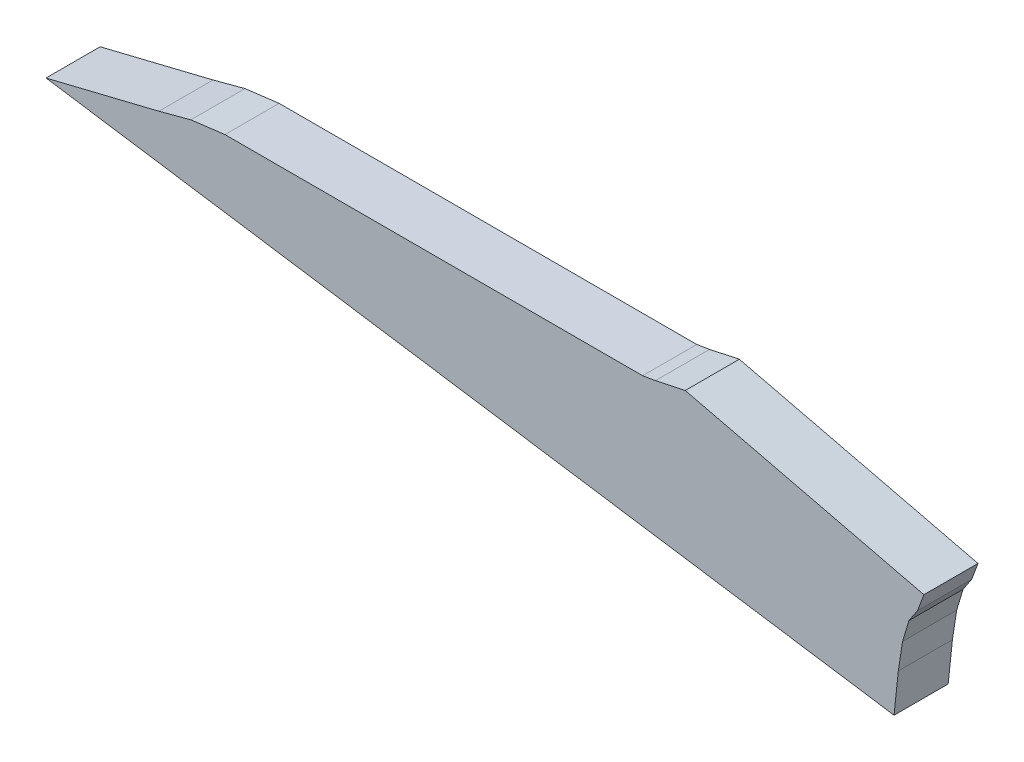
from build123d import *

# Parameters (mm, degrees)
EXTRUDE1_DEPTH = 25.4


with BuildPart() as part:
    # Sketch1 → Extrude1 (new body)
    with BuildSketch(Plane.XY.offset(8.4)):
        Polygon((276, 126), (674, 66), (676, 85), (678, 98), (681, 108), (685, 114), (688, 122), (576, 149), (562, 146), (556, 145), (360, 145), (344, 143), (329, 139), align=None)
    extrude(amount=-EXTRUDE1_DEPTH)


solid = part.part
